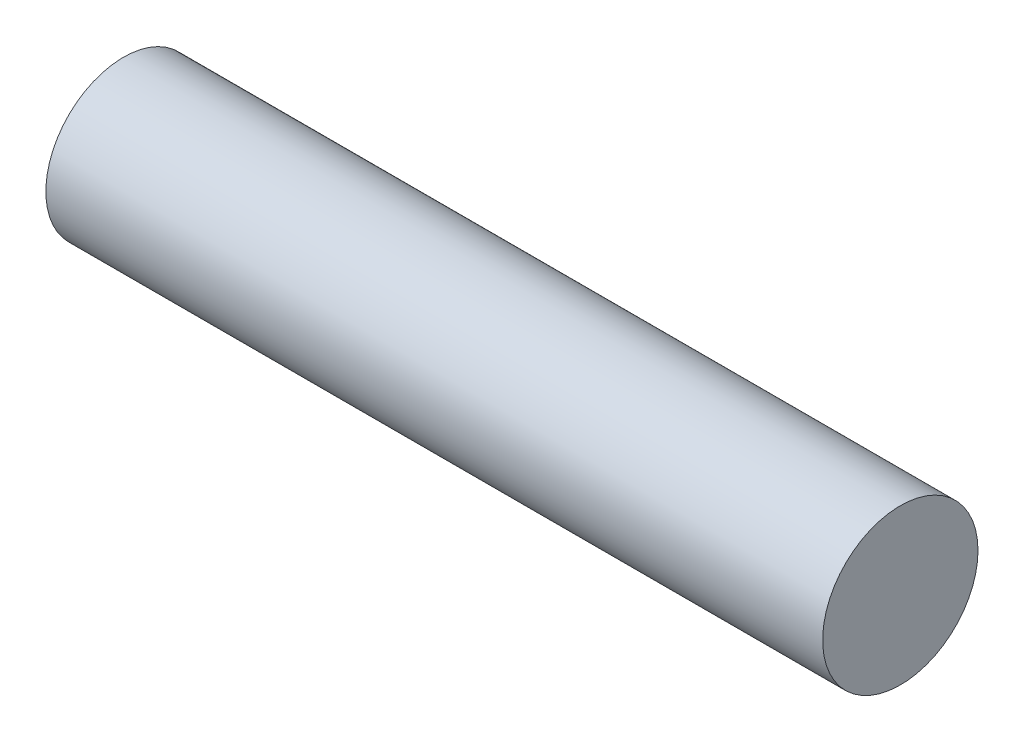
from build123d import *

# Parameters (mm, degrees)
SKETCH1_R           = 3
BOSS_EXTRUDE1_DEPTH = 30


with BuildPart() as part:
    # Sketch1 → Boss-Extrude1 (new body)
    with BuildSketch(Plane(origin=(0, 0, 0), x_dir=(0, 0, -1), z_dir=(1, 0, 0))):
        Circle(SKETCH1_R)
    extrude(amount=BOSS_EXTRUDE1_DEPTH)


solid = part.part
